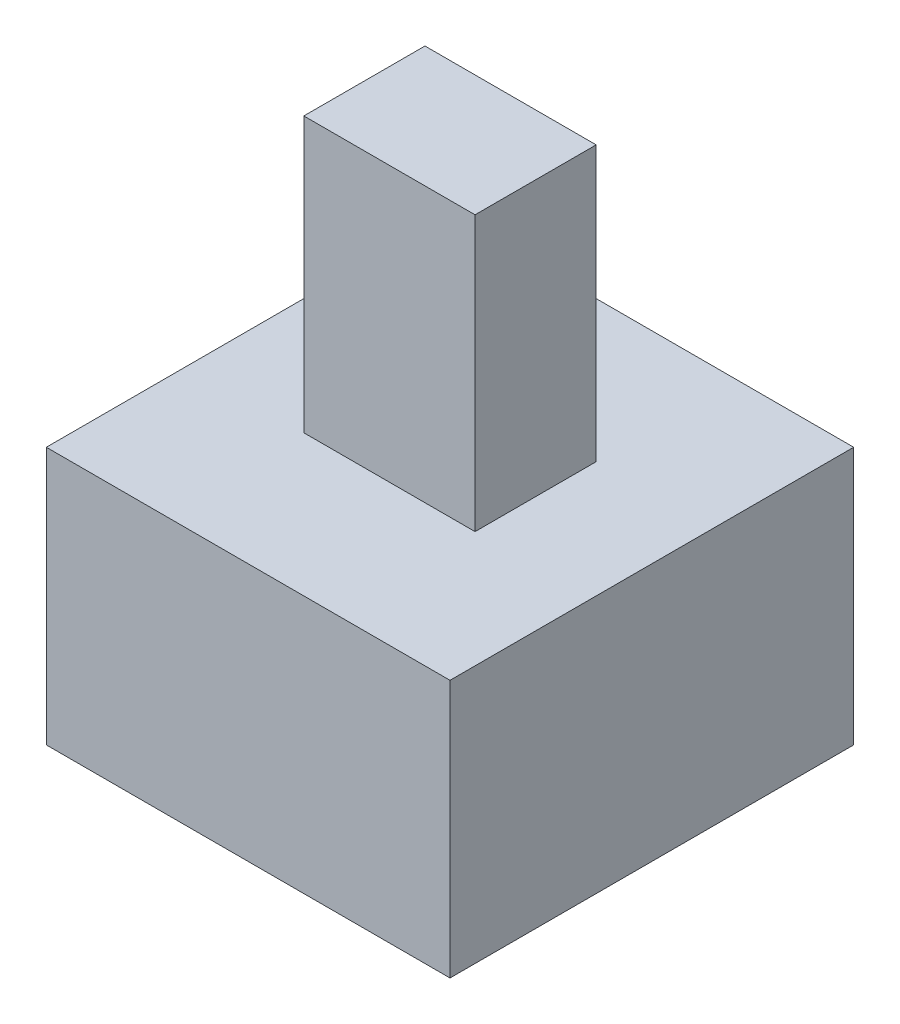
ISO-10303-21;
HEADER;
FILE_DESCRIPTION(('STEP AP214'),'2;1');
FILE_NAME('part.step','',(''),(''),'','','');
FILE_SCHEMA(('AUTOMOTIVE_DESIGN { 1 0 10303 214 1 1 1 1 }'));
ENDSEC;
DATA;
#1=APPLICATION_CONTEXT('core data for automotive mechanical design processes');
#2=APPLICATION_PROTOCOL_DEFINITION('international standard','automotive_design',2000,#1);
#3=PRODUCT_CONTEXT('',#1,'mechanical');
#4=PRODUCT('Part','Part','',(#3));
#5=PRODUCT_RELATED_PRODUCT_CATEGORY('part','',(#4));
#6=PRODUCT_DEFINITION_FORMATION('','',#4);
#7=PRODUCT_DEFINITION_CONTEXT('part definition',#1,'design');
#8=PRODUCT_DEFINITION('design','',#6,#7);
#9=PRODUCT_DEFINITION_SHAPE('','',#8);
#10=(LENGTH_UNIT() NAMED_UNIT(*) SI_UNIT(.MILLI.,.METRE.));
#11=(NAMED_UNIT(*) PLANE_ANGLE_UNIT() SI_UNIT($,.RADIAN.));
#12=(NAMED_UNIT(*) SI_UNIT($,.STERADIAN.) SOLID_ANGLE_UNIT());
#13=UNCERTAINTY_MEASURE_WITH_UNIT(LENGTH_MEASURE(1.E-05),#10,'distance_accuracy_value','');
#14=(GEOMETRIC_REPRESENTATION_CONTEXT(3) GLOBAL_UNCERTAINTY_ASSIGNED_CONTEXT((#13)) GLOBAL_UNIT_ASSIGNED_CONTEXT((#10,
#11,#12)) REPRESENTATION_CONTEXT('',''));
#15=CARTESIAN_POINT('',(0.,0.,0.));
#16=DIRECTION('',(0.,0.,1.));
#17=DIRECTION('',(1.,0.,0.));
#18=AXIS2_PLACEMENT_3D('',#15,#16,#17);
#19=CARTESIAN_POINT('',(-48.7636206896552,62.2905206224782,48.7636206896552));
#20=DIRECTION('',(0.,1.,0.));
#21=DIRECTION('',(0.,0.,1.));
#22=AXIS2_PLACEMENT_3D('',#19,#20,#21);
#23=PLANE('',#22);
#24=DIRECTION('',(0.,0.,1.));
#25=VECTOR('',#24,1.);
#26=CARTESIAN_POINT('',(-48.7636206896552,62.2905206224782,-48.7636206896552));
#27=LINE('',#26,#25);
#28=CARTESIAN_POINT('',(-48.7636206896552,62.2905206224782,-48.7636206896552));
#29=VERTEX_POINT('',#28);
#30=CARTESIAN_POINT('',(-48.7636206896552,62.2905206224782,48.7636206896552));
#31=VERTEX_POINT('',#30);
#32=EDGE_CURVE('E140',#29,#31,#27,.T.);
#33=ORIENTED_EDGE('',*,*,#32,.T.);
#34=DIRECTION('',(1.,0.,0.));
#35=VECTOR('',#34,1.);
#36=CARTESIAN_POINT('',(-48.7636206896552,62.2905206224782,48.7636206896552));
#37=LINE('',#36,#35);
#38=CARTESIAN_POINT('',(48.7636206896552,62.2905206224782,48.7636206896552));
#39=VERTEX_POINT('',#38);
#40=EDGE_CURVE('E142',#31,#39,#37,.T.);
#41=ORIENTED_EDGE('',*,*,#40,.T.);
#42=DIRECTION('',(0.,0.,-1.));
#43=VECTOR('',#42,1.);
#44=CARTESIAN_POINT('',(48.7636206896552,62.2905206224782,-48.7636206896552));
#45=LINE('',#44,#43);
#46=CARTESIAN_POINT('',(48.7636206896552,62.2905206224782,-48.7636206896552));
#47=VERTEX_POINT('',#46);
#48=EDGE_CURVE('E144',#39,#47,#45,.T.);
#49=ORIENTED_EDGE('',*,*,#48,.T.);
#50=DIRECTION('',(-1.,0.,0.));
#51=VECTOR('',#50,1.);
#52=CARTESIAN_POINT('',(-48.7636206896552,62.2905206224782,-48.7636206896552));
#53=LINE('',#52,#51);
#54=EDGE_CURVE('E49',#47,#29,#53,.T.);
#55=ORIENTED_EDGE('',*,*,#54,.T.);
#56=EDGE_LOOP('',(#33,#41,#49,#55));
#57=FACE_BOUND('',#56,.T.);
#58=DIRECTION('',(-1.,0.,0.));
#59=VECTOR('',#58,1.);
#60=CARTESIAN_POINT('',(20.6823062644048,62.2905206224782,-14.6327408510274));
#61=LINE('',#60,#59);
#62=CARTESIAN_POINT('',(20.6823062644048,62.2905206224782,-14.6327408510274));
#63=VERTEX_POINT('',#62);
#64=CARTESIAN_POINT('',(-20.6823062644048,62.2905206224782,-14.6327408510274));
#65=VERTEX_POINT('',#64);
#66=EDGE_CURVE('E97',#63,#65,#61,.T.);
#67=ORIENTED_EDGE('',*,*,#66,.F.);
#68=DIRECTION('',(0.,0.,-1.));
#69=VECTOR('',#68,1.);
#70=CARTESIAN_POINT('',(20.6823062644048,62.2905206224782,14.6327408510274));
#71=LINE('',#70,#69);
#72=CARTESIAN_POINT('',(20.6823062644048,62.2905206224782,14.6327408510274));
#73=VERTEX_POINT('',#72);
#74=EDGE_CURVE('E108',#73,#63,#71,.T.);
#75=ORIENTED_EDGE('',*,*,#74,.F.);
#76=DIRECTION('',(1.,0.,0.));
#77=VECTOR('',#76,1.);
#78=CARTESIAN_POINT('',(20.6823062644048,62.2905206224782,14.6327408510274));
#79=LINE('',#78,#77);
#80=CARTESIAN_POINT('',(-20.6823062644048,62.2905206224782,14.6327408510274));
#81=VERTEX_POINT('',#80);
#82=EDGE_CURVE('E118',#81,#73,#79,.T.);
#83=ORIENTED_EDGE('',*,*,#82,.F.);
#84=DIRECTION('',(0.,0.,1.));
#85=VECTOR('',#84,1.);
#86=CARTESIAN_POINT('',(-20.6823062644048,62.2905206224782,14.6327408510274));
#87=LINE('',#86,#85);
#88=EDGE_CURVE('E116',#65,#81,#87,.T.);
#89=ORIENTED_EDGE('',*,*,#88,.F.);
#90=EDGE_LOOP('',(#67,#75,#83,#89));
#91=FACE_BOUND('',#90,.T.);
#92=ADVANCED_FACE('F26',(#57,#91),#23,.T.);
#93=CARTESIAN_POINT('',(-48.7636206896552,62.2905206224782,-48.7636206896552));
#94=DIRECTION('',(1.,0.,0.));
#95=DIRECTION('',(0.,0.,-1.));
#96=AXIS2_PLACEMENT_3D('',#93,#94,#95);
#97=PLANE('',#96);
#98=DIRECTION('',(0.,0.,1.));
#99=VECTOR('',#98,1.);
#100=CARTESIAN_POINT('',(-48.7636206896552,0.,-48.7636206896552));
#101=LINE('',#100,#99);
#102=CARTESIAN_POINT('',(-48.7636206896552,0.,-48.7636206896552));
#103=VERTEX_POINT('',#102);
#104=CARTESIAN_POINT('',(-48.7636206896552,0.,48.7636206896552));
#105=VERTEX_POINT('',#104);
#106=EDGE_CURVE('E103',#103,#105,#101,.T.);
#107=ORIENTED_EDGE('',*,*,#106,.T.);
#108=DIRECTION('',(0.,-1.,0.));
#109=VECTOR('',#108,1.);
#110=CARTESIAN_POINT('',(-48.7636206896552,62.2905206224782,48.7636206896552));
#111=LINE('',#110,#109);
#112=EDGE_CURVE('E11',#31,#105,#111,.T.);
#113=ORIENTED_EDGE('',*,*,#112,.F.);
#114=ORIENTED_EDGE('',*,*,#32,.F.);
#115=DIRECTION('',(0.,-1.,0.));
#116=VECTOR('',#115,1.);
#117=CARTESIAN_POINT('',(-48.7636206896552,62.2905206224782,-48.7636206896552));
#118=LINE('',#117,#116);
#119=EDGE_CURVE('E147',#29,#103,#118,.T.);
#120=ORIENTED_EDGE('',*,*,#119,.T.);
#121=EDGE_LOOP('',(#107,#113,#114,#120));
#122=FACE_BOUND('',#121,.T.);
#123=ADVANCED_FACE('F28',(#122),#97,.F.);
#124=CARTESIAN_POINT('',(-48.7636206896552,62.2905206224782,48.7636206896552));
#125=DIRECTION('',(0.,0.,-1.));
#126=DIRECTION('',(-1.,0.,0.));
#127=AXIS2_PLACEMENT_3D('',#124,#125,#126);
#128=PLANE('',#127);
#129=DIRECTION('',(1.,0.,0.));
#130=VECTOR('',#129,1.);
#131=CARTESIAN_POINT('',(-48.7636206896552,0.,48.7636206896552));
#132=LINE('',#131,#130);
#133=CARTESIAN_POINT('',(48.7636206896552,0.,48.7636206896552));
#134=VERTEX_POINT('',#133);
#135=EDGE_CURVE('E134',#105,#134,#132,.T.);
#136=ORIENTED_EDGE('',*,*,#135,.T.);
#137=DIRECTION('',(0.,-1.,0.));
#138=VECTOR('',#137,1.);
#139=CARTESIAN_POINT('',(48.7636206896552,62.2905206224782,48.7636206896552));
#140=LINE('',#139,#138);
#141=EDGE_CURVE('E34',#39,#134,#140,.T.);
#142=ORIENTED_EDGE('',*,*,#141,.F.);
#143=ORIENTED_EDGE('',*,*,#40,.F.);
#144=ORIENTED_EDGE('',*,*,#112,.T.);
#145=EDGE_LOOP('',(#136,#142,#143,#144));
#146=FACE_BOUND('',#145,.T.);
#147=ADVANCED_FACE('F169',(#146),#128,.F.);
#148=CARTESIAN_POINT('',(48.7636206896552,62.2905206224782,-48.7636206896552));
#149=DIRECTION('',(-1.,0.,0.));
#150=DIRECTION('',(0.,0.,1.));
#151=AXIS2_PLACEMENT_3D('',#148,#149,#150);
#152=PLANE('',#151);
#153=DIRECTION('',(0.,0.,-1.));
#154=VECTOR('',#153,1.);
#155=CARTESIAN_POINT('',(48.7636206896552,0.,-48.7636206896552));
#156=LINE('',#155,#154);
#157=CARTESIAN_POINT('',(48.7636206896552,0.,-48.7636206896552));
#158=VERTEX_POINT('',#157);
#159=EDGE_CURVE('E136',#134,#158,#156,.T.);
#160=ORIENTED_EDGE('',*,*,#159,.T.);
#161=DIRECTION('',(0.,-1.,0.));
#162=VECTOR('',#161,1.);
#163=CARTESIAN_POINT('',(48.7636206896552,62.2905206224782,-48.7636206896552));
#164=LINE('',#163,#162);
#165=EDGE_CURVE('E150',#47,#158,#164,.T.);
#166=ORIENTED_EDGE('',*,*,#165,.F.);
#167=ORIENTED_EDGE('',*,*,#48,.F.);
#168=ORIENTED_EDGE('',*,*,#141,.T.);
#169=EDGE_LOOP('',(#160,#166,#167,#168));
#170=FACE_BOUND('',#169,.T.);
#171=ADVANCED_FACE('F157',(#170),#152,.F.);
#172=CARTESIAN_POINT('',(-48.7636206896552,62.2905206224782,-48.7636206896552));
#173=DIRECTION('',(0.,0.,1.));
#174=DIRECTION('',(1.,0.,0.));
#175=AXIS2_PLACEMENT_3D('',#172,#173,#174);
#176=PLANE('',#175);
#177=DIRECTION('',(-1.,0.,0.));
#178=VECTOR('',#177,1.);
#179=CARTESIAN_POINT('',(-48.7636206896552,0.,-48.7636206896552));
#180=LINE('',#179,#178);
#181=EDGE_CURVE('E138',#158,#103,#180,.T.);
#182=ORIENTED_EDGE('',*,*,#181,.T.);
#183=ORIENTED_EDGE('',*,*,#119,.F.);
#184=ORIENTED_EDGE('',*,*,#54,.F.);
#185=ORIENTED_EDGE('',*,*,#165,.T.);
#186=EDGE_LOOP('',(#182,#183,#184,#185));
#187=FACE_BOUND('',#186,.T.);
#188=ADVANCED_FACE('F165',(#187),#176,.F.);
#189=CARTESIAN_POINT('',(-48.7636206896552,0.,48.7636206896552));
#190=DIRECTION('',(0.,1.,0.));
#191=DIRECTION('',(0.,0.,1.));
#192=AXIS2_PLACEMENT_3D('',#189,#190,#191);
#193=PLANE('',#192);
#194=ORIENTED_EDGE('',*,*,#106,.F.);
#195=ORIENTED_EDGE('',*,*,#181,.F.);
#196=ORIENTED_EDGE('',*,*,#159,.F.);
#197=ORIENTED_EDGE('',*,*,#135,.F.);
#198=EDGE_LOOP('',(#194,#195,#196,#197));
#199=FACE_BOUND('',#198,.T.);
#200=ADVANCED_FACE('F163',(#199),#193,.F.);
#201=CARTESIAN_POINT('',(20.6823062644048,128.586993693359,14.6327408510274));
#202=DIRECTION('',(-1.,0.,0.));
#203=DIRECTION('',(0.,0.,1.));
#204=AXIS2_PLACEMENT_3D('',#201,#202,#203);
#205=PLANE('',#204);
#206=ORIENTED_EDGE('',*,*,#74,.T.);
#207=DIRECTION('',(0.,-1.,0.));
#208=VECTOR('',#207,1.);
#209=CARTESIAN_POINT('',(20.6823062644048,128.586993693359,-14.6327408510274));
#210=LINE('',#209,#208);
#211=CARTESIAN_POINT('',(20.6823062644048,128.586993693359,-14.6327408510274));
#212=VERTEX_POINT('',#211);
#213=EDGE_CURVE('E92',#212,#63,#210,.T.);
#214=ORIENTED_EDGE('',*,*,#213,.F.);
#215=DIRECTION('',(0.,0.,-1.));
#216=VECTOR('',#215,1.);
#217=CARTESIAN_POINT('',(20.6823062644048,128.586993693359,14.6327408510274));
#218=LINE('',#217,#216);
#219=CARTESIAN_POINT('',(20.6823062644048,128.586993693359,14.6327408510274));
#220=VERTEX_POINT('',#219);
#221=EDGE_CURVE('E122',#220,#212,#218,.T.);
#222=ORIENTED_EDGE('',*,*,#221,.F.);
#223=DIRECTION('',(0.,-1.,0.));
#224=VECTOR('',#223,1.);
#225=CARTESIAN_POINT('',(20.6823062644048,128.586993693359,14.6327408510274));
#226=LINE('',#225,#224);
#227=EDGE_CURVE('E111',#220,#73,#226,.T.);
#228=ORIENTED_EDGE('',*,*,#227,.T.);
#229=EDGE_LOOP('',(#206,#214,#222,#228));
#230=FACE_BOUND('',#229,.T.);
#231=ADVANCED_FACE('F109',(#230),#205,.F.);
#232=CARTESIAN_POINT('',(20.6823062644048,128.586993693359,-14.6327408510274));
#233=DIRECTION('',(0.,0.,1.));
#234=DIRECTION('',(1.,0.,0.));
#235=AXIS2_PLACEMENT_3D('',#232,#233,#234);
#236=PLANE('',#235);
#237=ORIENTED_EDGE('',*,*,#66,.T.);
#238=DIRECTION('',(0.,-1.,0.));
#239=VECTOR('',#238,1.);
#240=CARTESIAN_POINT('',(-20.6823062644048,128.586993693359,-14.6327408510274));
#241=LINE('',#240,#239);
#242=CARTESIAN_POINT('',(-20.6823062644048,128.586993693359,-14.6327408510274));
#243=VERTEX_POINT('',#242);
#244=EDGE_CURVE('E104',#243,#65,#241,.T.);
#245=ORIENTED_EDGE('',*,*,#244,.F.);
#246=DIRECTION('',(-1.,0.,0.));
#247=VECTOR('',#246,1.);
#248=CARTESIAN_POINT('',(20.6823062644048,128.586993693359,-14.6327408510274));
#249=LINE('',#248,#247);
#250=EDGE_CURVE('E99',#212,#243,#249,.T.);
#251=ORIENTED_EDGE('',*,*,#250,.F.);
#252=ORIENTED_EDGE('',*,*,#213,.T.);
#253=EDGE_LOOP('',(#237,#245,#251,#252));
#254=FACE_BOUND('',#253,.T.);
#255=ADVANCED_FACE('F94',(#254),#236,.F.);
#256=CARTESIAN_POINT('',(-20.6823062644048,128.586993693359,14.6327408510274));
#257=DIRECTION('',(1.,0.,0.));
#258=DIRECTION('',(0.,0.,-1.));
#259=AXIS2_PLACEMENT_3D('',#256,#257,#258);
#260=PLANE('',#259);
#261=ORIENTED_EDGE('',*,*,#88,.T.);
#262=DIRECTION('',(0.,-1.,0.));
#263=VECTOR('',#262,1.);
#264=CARTESIAN_POINT('',(-20.6823062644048,128.586993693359,14.6327408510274));
#265=LINE('',#264,#263);
#266=CARTESIAN_POINT('',(-20.6823062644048,128.586993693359,14.6327408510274));
#267=VERTEX_POINT('',#266);
#268=EDGE_CURVE('E41',#267,#81,#265,.T.);
#269=ORIENTED_EDGE('',*,*,#268,.F.);
#270=DIRECTION('',(0.,0.,1.));
#271=VECTOR('',#270,1.);
#272=CARTESIAN_POINT('',(-20.6823062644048,128.586993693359,14.6327408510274));
#273=LINE('',#272,#271);
#274=EDGE_CURVE('E125',#243,#267,#273,.T.);
#275=ORIENTED_EDGE('',*,*,#274,.F.);
#276=ORIENTED_EDGE('',*,*,#244,.T.);
#277=EDGE_LOOP('',(#261,#269,#275,#276));
#278=FACE_BOUND('',#277,.T.);
#279=ADVANCED_FACE('F193',(#278),#260,.F.);
#280=CARTESIAN_POINT('',(20.6823062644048,128.586993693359,14.6327408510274));
#281=DIRECTION('',(0.,0.,-1.));
#282=DIRECTION('',(-1.,0.,0.));
#283=AXIS2_PLACEMENT_3D('',#280,#281,#282);
#284=PLANE('',#283);
#285=ORIENTED_EDGE('',*,*,#82,.T.);
#286=ORIENTED_EDGE('',*,*,#227,.F.);
#287=DIRECTION('',(1.,0.,0.));
#288=VECTOR('',#287,1.);
#289=CARTESIAN_POINT('',(20.6823062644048,128.586993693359,14.6327408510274));
#290=LINE('',#289,#288);
#291=EDGE_CURVE('E127',#267,#220,#290,.T.);
#292=ORIENTED_EDGE('',*,*,#291,.F.);
#293=ORIENTED_EDGE('',*,*,#268,.T.);
#294=EDGE_LOOP('',(#285,#286,#292,#293));
#295=FACE_BOUND('',#294,.T.);
#296=ADVANCED_FACE('F198',(#295),#284,.F.);
#297=CARTESIAN_POINT('',(20.6823062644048,128.586993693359,-14.6327408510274));
#298=DIRECTION('',(0.,1.,0.));
#299=DIRECTION('',(0.,0.,1.));
#300=AXIS2_PLACEMENT_3D('',#297,#298,#299);
#301=PLANE('',#300);
#302=ORIENTED_EDGE('',*,*,#221,.T.);
#303=ORIENTED_EDGE('',*,*,#250,.T.);
#304=ORIENTED_EDGE('',*,*,#274,.T.);
#305=ORIENTED_EDGE('',*,*,#291,.T.);
#306=EDGE_LOOP('',(#302,#303,#304,#305));
#307=FACE_BOUND('',#306,.T.);
#308=ADVANCED_FACE('F202',(#307),#301,.T.);
#309=CLOSED_SHELL('',(#92,#123,#147,#171,#188,#200,#231,#255,#279,#296,#308));
#310=MANIFOLD_SOLID_BREP('B2',#309);
#311=ADVANCED_BREP_SHAPE_REPRESENTATION('',(#18,#310),#14);
#312=SHAPE_DEFINITION_REPRESENTATION(#9,#311);
ENDSEC;
END-ISO-10303-21;
